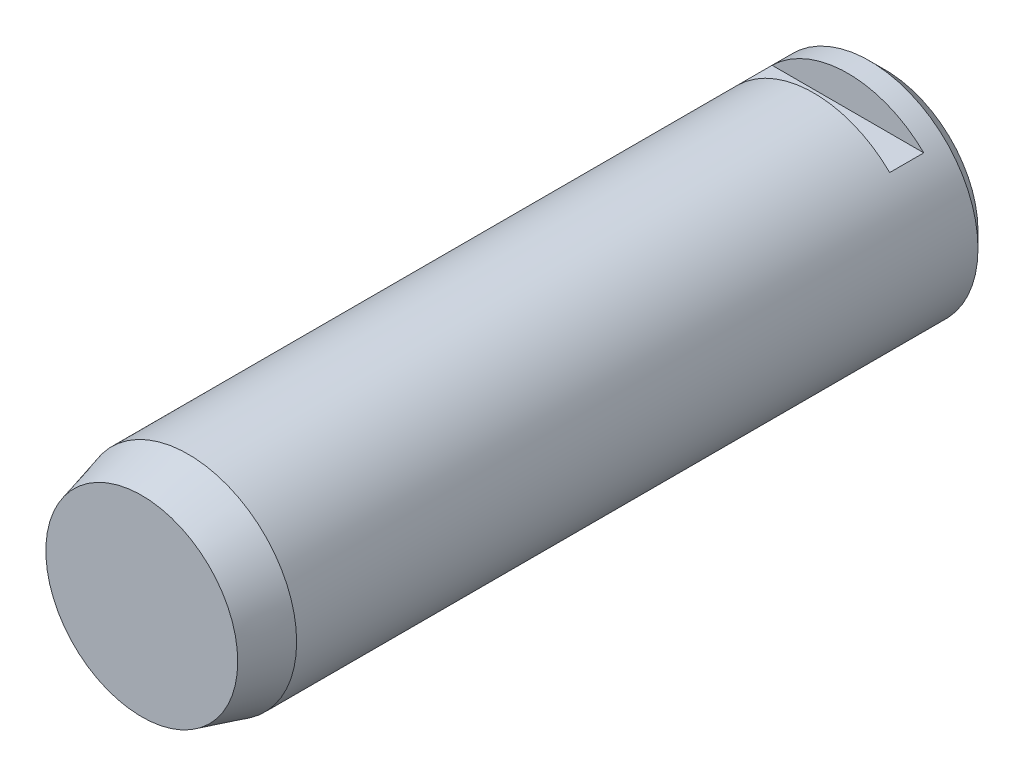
from build123d import *

# Parameters (mm, degrees)
ESQUISSE1_R             = 35
EXTRUSION1_DEPTH        = 240
CHANFREIN1_SIZE         = 15
CHANFREIN1_SIZE2        = 4.019237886
ENL_V_MAT_EXTRU_1_REACH = 251.85
ESQUISSE2_W             = 70
ESQUISSE2_H             = 11
CHANFREIN2_SIZE         = 5


with BuildPart() as part:
    # Esquisse1 → Extrusion1 (new body)
    with BuildSketch(Plane.XY):
        Circle(ESQUISSE1_R)
    extrude(amount=EXTRUSION1_DEPTH)

    # Chanfrein1
    chanfrein1_edges = [part.edges().sort_by_distance(p)[0] for p in [
        (-35, 0, 240),
    ]]
    chanfrein1_side = [part.faces().sort_by_distance(p)[0] for p in [
        (-35, 0, 120),
    ]]
    chamfer(chanfrein1_edges, length=CHANFREIN1_SIZE, length2=CHANFREIN1_SIZE2, reference=chanfrein1_side[0])

    # Esquisse2 → Enl_v. mat.-Extru.1 (cut, up to next)
    with BuildSketch(Plane(origin=(0, 25, 0), x_dir=(-1, 0, 0), z_dir=(0, 1, 0)), mode=Mode.PRIVATE) as enl_v_mat_extru_1_sk1:
        with Locations((0, 17.5)):
            Rectangle(ESQUISSE2_W, ESQUISSE2_H)
    enl_v_mat_extru_1_tool1 = extrude(enl_v_mat_extru_1_sk1.sketch, amount=ENL_V_MAT_EXTRU_1_REACH, mode=Mode.PRIVATE) & part.part
    add(enl_v_mat_extru_1_tool1.solids().sort_by_distance((0, 25, 17.5))[0], mode=Mode.SUBTRACT)

    # Chanfrein2
    chanfrein2_edges = [part.edges().sort_by_distance(p)[0] for p in [
        (-35, 0, 0),
    ]]
    chamfer(chanfrein2_edges, length=CHANFREIN2_SIZE)


solid = part.part
